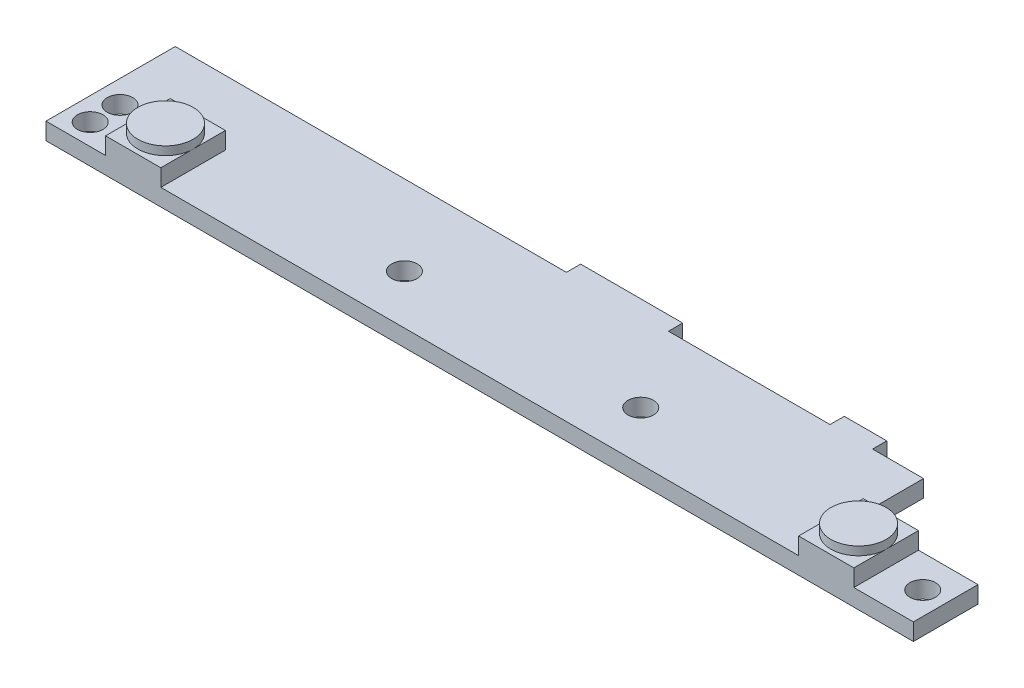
from build123d import *

# Parameters (mm, degrees)
SKETCH1_W                    = 102
SKETCH1_H                    = 7.6
BOSS_EXTRUDE1_DEPTH          = 4
SKETCH2_W                    = 88.5
SKETCH2_H                    = 2
CUT_EXTRUDE1_DEPTH           = 52.718081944
SKETCH3_W                    = 88
SKETCH3_H                    = 2
BOSS_EXTRUDE2_DEPTH          = 9.27313023
SKETCH4_W                    = 19
SKETCH4_H                    = 1.67313023
CUT_EXTRUDE2_DEPTH           = 52.874762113
SKETCH5_W                    = 6
SKETCH5_H                    = 1.67313023
CUT_EXTRUDE3_DEPTH           = 52.874762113
SKETCH6_W                    = 46
SKETCH6_H                    = 1.67313023
CUT_EXTRUDE4_DEPTH           = 52.990296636
SKETCH7_W                    = 7
SKETCH7_H                    = 2
CUT_EXTRUDE5_DEPTH           = 54.867453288
SKETCH8_W                    = 6.5
SKETCH8_H                    = 7.6
BOSS_EXTRUDE3_DEPTH          = 2
SKETCH9_W                    = 3.25
SKETCH9_H                    = 1
SKETCH10_W                   = 3.25
SKETCH10_H                   = 1
F_3_0_3_DIAMETER_HOLE1_D     = 3
F_3_0_3_DIAMETER_HOLE1_DEPTH = 5


with BuildPart() as part:
    # Sketch1 → Boss-Extrude1 (new body)
    with BuildSketch(Plane.XZ):
        with Locations((0, 3.8)):
            Rectangle(SKETCH1_W, SKETCH1_H)
    extrude(amount=-BOSS_EXTRUDE1_DEPTH)

    # Sketch2 → Cut-Extrude1 (cut, through all)
    with BuildSketch(Plane.XY.offset(7.6)):
        with Locations((-6.75, 3)):
            Rectangle(SKETCH2_W, SKETCH2_H)
    extrude(amount=-CUT_EXTRUDE1_DEPTH, mode=Mode.SUBTRACT)

    # Sketch3 → Boss-Extrude2 (add)
    with BuildSketch(Plane(origin=(0, 0, 0), x_dir=(-1, 0, 0), z_dir=(0, 0, -1))):
        with Locations((7, 1)):
            Rectangle(SKETCH3_W, SKETCH3_H)
    extrude(amount=BOSS_EXTRUDE2_DEPTH)

    # Sketch4 → Cut-Extrude2 (cut, through all)
    with BuildSketch(Plane(origin=(0, 2, 0), x_dir=(-1, 0, 0), z_dir=(0, 1, 0))):
        with Locations((-16.5, -8.436565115)):
            Rectangle(SKETCH4_W, SKETCH4_H)
    extrude(amount=-CUT_EXTRUDE2_DEPTH, mode=Mode.SUBTRACT)

    # Sketch5 → Cut-Extrude3 (cut, through all)
    with BuildSketch(Plane(origin=(0, 2, 0), x_dir=(-1, 0, 0), z_dir=(0, 1, 0))):
        with Locations((-34, -8.436565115)):
            Rectangle(SKETCH5_W, SKETCH5_H)
    extrude(amount=-CUT_EXTRUDE3_DEPTH, mode=Mode.SUBTRACT)

    # Sketch6 → Cut-Extrude4 (cut, through all)
    with BuildSketch(Plane.XZ):
        with Locations((-28, -8.436565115)):
            Rectangle(SKETCH6_W, SKETCH6_H)
    extrude(amount=-CUT_EXTRUDE4_DEPTH, mode=Mode.SUBTRACT)

    # Sketch7 → Cut-Extrude5 (cut, through all)
    with BuildSketch(Plane.XY.offset(7.6)):
        with Locations((47.5, 3)):
            Rectangle(SKETCH7_W, SKETCH7_H)
    extrude(amount=-CUT_EXTRUDE5_DEPTH, mode=Mode.SUBTRACT)

    # Sketch8 → Boss-Extrude3 (add)
    with BuildSketch(Plane(origin=(0, 2, 0), x_dir=(-1, 0, 0), z_dir=(0, 1, 0))):
        with Locations((40.75, 3.8)):
            Rectangle(SKETCH8_W, SKETCH8_H)
    extrude(amount=BOSS_EXTRUDE3_DEPTH)

    # Sketch9 → Revolve1 (revolve)
    with BuildSketch(Plane(origin=(0, 0, 3.8), x_dir=(-1, 0, 0), z_dir=(0, 0, -1)), mode=Mode.PRIVATE) as revolve1_sk:
        with Locations((39.125, 4.5)):
            Rectangle(SKETCH9_W, SKETCH9_H)
    revolve(revolve1_sk.sketch.rotate(Axis((-40.75, 4, 3.8), (0, 1, 0)), 270), axis=Axis((-40.75, 4, 3.8), (0, 1, 0)))

    # Sketch10 → Revolve2 (revolve)
    with BuildSketch(Plane(origin=(0, 0, 3.8), x_dir=(-1, 0, 0), z_dir=(0, 0, -1)), mode=Mode.PRIVATE) as revolve2_sk:
        with Locations((-42.375, 4.5)):
            Rectangle(SKETCH10_W, SKETCH10_H)
    revolve(revolve2_sk.sketch.rotate(Axis((40.75, 4, 3.8), (0, 1, 0)), 270), axis=Axis((40.75, 4, 3.8), (0, 1, 0)))

    # 3.0 _3_ Diameter Hole1
    with Locations(Plane(origin=(0, 0, 0), x_dir=(-1, 0, 0), z_dir=(0, -1, 0))):
        with Locations((48.3, -5.1), (-13.149466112, -1.810306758), (-48.3, -3.8), (48.3, -1.6), (14.639076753, -1.810306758)):
            Hole(F_3_0_3_DIAMETER_HOLE1_D / 2, depth=F_3_0_3_DIAMETER_HOLE1_DEPTH)


solid = part.part
